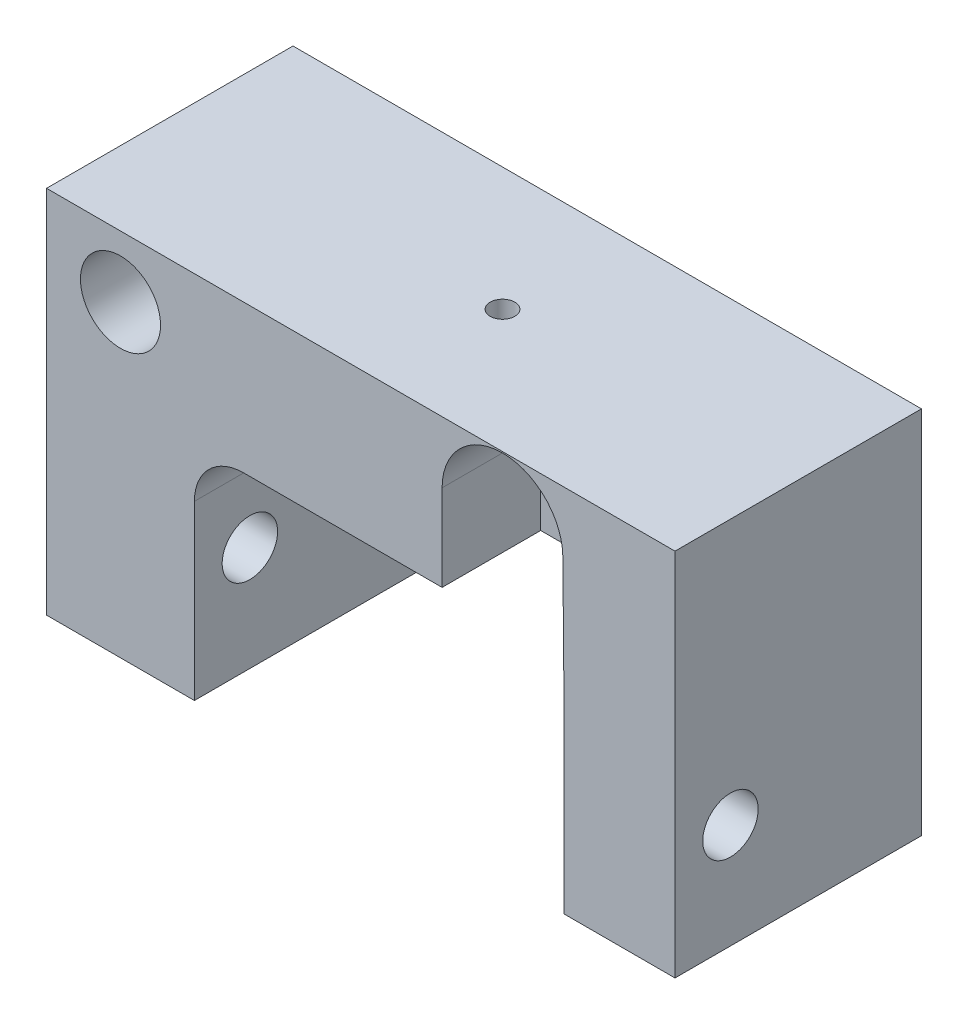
from build123d import *

# Parameters (mm, degrees)
SALIENTE_EXTRUIR1_DEPTH = 20
CORTAR_EXTRUIR1_REACH   = 46.162
CROQUIS2_R              = 1
CROQUIS3_R              = 2.25
CORTAR_EXTRUIR2_DEPTH   = 57.797887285
CROQUIS4_R              = 1.6
CORTAR_EXTRUIR3_DEPTH   = 20
CROQUIS5_R              = 12.369521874
CORTAR_EXTRUIR4_DEPTH   = 2.2
CROQUIS6_R              = 3.25
CORTAR_EXTRUIR5_DEPTH   = 6
CORTAR_EXTRUIR7_DEPTH   = 8


with BuildPart() as part:
    # Croquis1 → Saliente-Extruir1 (new body)
    with BuildSketch(Plane.XY):
        with BuildLine():
            Line((-25.5, -15), (-13.5, -15))
            Line((-13.5, -15), (-13.5, -1))
            ThreePointArc((-13.5, -1), (-12.328427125, 1.828427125), (-9.5, 3))
            Line((-9.5, 3), (12.5, 3))
            ThreePointArc((12.5, 3), (15.328427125, 1.828427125), (16.5, -1))
            Line((16.5, -1), (16.5, -15))
            Line((16.5, -15), (25.5, -15))
            Line((25.5, -15), (25.5, 15))
            Line((25.5, 15), (-25.5, 15))
            Line((-25.5, 15), (-25.5, -15))
        make_face()
    extrude(amount=SALIENTE_EXTRUIR1_DEPTH)

    # Croquis2 → Cortar-Extruir1 (cut, up to next)
    with BuildSketch(Plane(origin=(0, 15, 0), x_dir=(1, 0, 0), z_dir=(0, 1, 0)), mode=Mode.PRIVATE) as cortar_extruir1_sk1:
        with Locations(Location((1.5, -10, 0), (0, 0, 270))):
            Circle(CROQUIS2_R)
    cortar_extruir1_tool1 = extrude(cortar_extruir1_sk1.sketch, amount=-CORTAR_EXTRUIR1_REACH, mode=Mode.PRIVATE) & part.part
    add(cortar_extruir1_tool1.solids().sort_by_distance((1.5, 15, 10))[0], mode=Mode.SUBTRACT)

    # Croquis3 → Cortar-Extruir2 (cut, through all)
    with BuildSketch(Plane(origin=(25.5, 0, 0), x_dir=(0, 0, -1), z_dir=(1, 0, 0))):
        with Locations((-15.5, -6.5)):
            Circle(CROQUIS3_R)
    extrude(amount=-CORTAR_EXTRUIR2_DEPTH, mode=Mode.SUBTRACT)

    # Croquis4 → Cortar-Extruir3 (cut)
    with BuildSketch(Plane(origin=(0, 0, 0), x_dir=(-1, 0, 0), z_dir=(0, 0, -1))):
        with Locations((-11.5, 10)):
            Circle(CROQUIS4_R)
        with Locations((19.5, 10)):
            Circle(CROQUIS4_R)
    extrude(amount=-CORTAR_EXTRUIR3_DEPTH, mode=Mode.SUBTRACT)

    # Croquis5 → Cortar-Extruir4 (cut)
    with BuildSketch(Plane(origin=(0, 0, 0), x_dir=(-1, 0, 0), z_dir=(0, 0, -1))):
        with Locations((3.4310145, -6.763359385)):
            Circle(CROQUIS5_R)
    extrude(amount=-CORTAR_EXTRUIR4_DEPTH, mode=Mode.SUBTRACT)

    # Croquis6 → Cortar-Extruir5 (cut)
    with BuildSketch(Plane.XY.offset(20)):
        with Locations((-19.5, 10)):
            Circle(CROQUIS6_R)
    extrude(amount=-CORTAR_EXTRUIR5_DEPTH, mode=Mode.SUBTRACT)

    # Croquis9 → Cortar-Extruir7 (cut)
    with BuildSketch(Plane.XY.offset(20)):
        with BuildLine():
            Line((16.399798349, 10.044453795), (16.5, -1))
            Line((16.5, -1), (6.6, -1))
            Line((6.6, -1), (6.6, 10))
            ThreePointArc((6.6, 10), (11.477772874, 14.899949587), (16.399798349, 10.044453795))
        make_face()
    extrude(amount=-CORTAR_EXTRUIR7_DEPTH, mode=Mode.SUBTRACT)


solid = part.part
